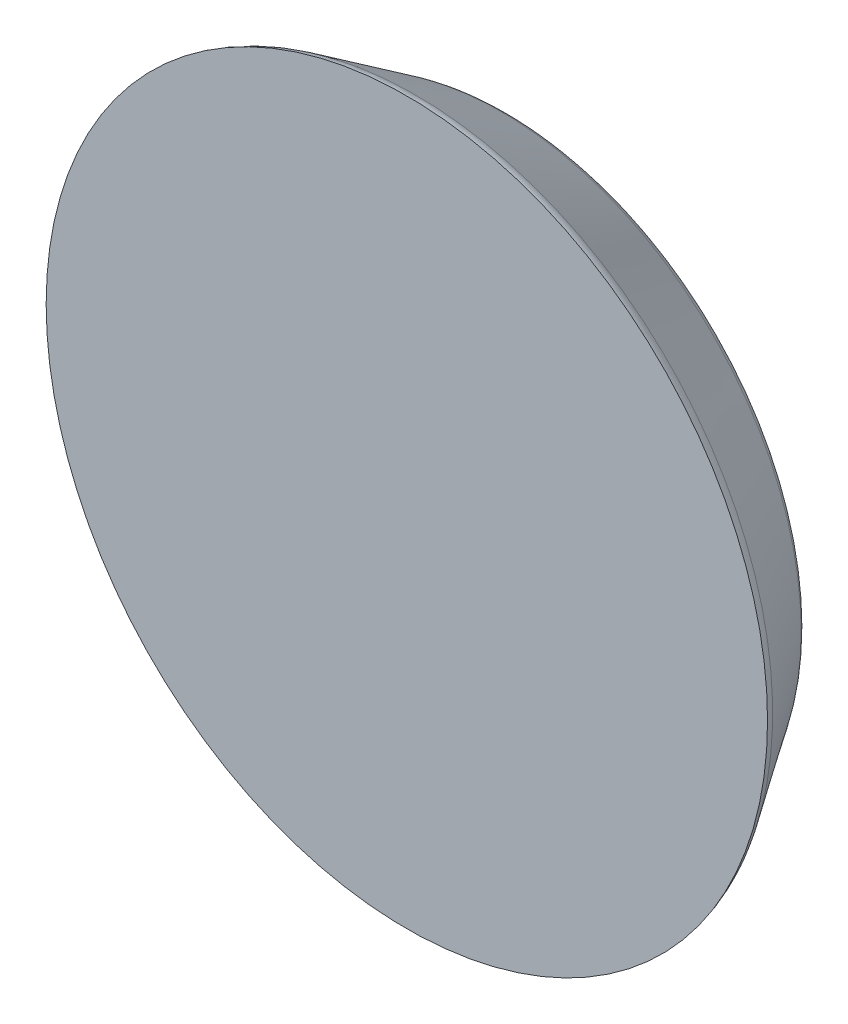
ISO-10303-21;
HEADER;
FILE_DESCRIPTION(('STEP AP214'),'2;1');
FILE_NAME('part.step','',(''),(''),'','','');
FILE_SCHEMA(('AUTOMOTIVE_DESIGN { 1 0 10303 214 1 1 1 1 }'));
ENDSEC;
DATA;
#1=APPLICATION_CONTEXT('core data for automotive mechanical design processes');
#2=APPLICATION_PROTOCOL_DEFINITION('international standard','automotive_design',2000,#1);
#3=PRODUCT_CONTEXT('',#1,'mechanical');
#4=PRODUCT('Part','Part','',(#3));
#5=PRODUCT_RELATED_PRODUCT_CATEGORY('part','',(#4));
#6=PRODUCT_DEFINITION_FORMATION('','',#4);
#7=PRODUCT_DEFINITION_CONTEXT('part definition',#1,'design');
#8=PRODUCT_DEFINITION('design','',#6,#7);
#9=PRODUCT_DEFINITION_SHAPE('','',#8);
#10=(LENGTH_UNIT() NAMED_UNIT(*) SI_UNIT(.MILLI.,.METRE.));
#11=(NAMED_UNIT(*) PLANE_ANGLE_UNIT() SI_UNIT($,.RADIAN.));
#12=(NAMED_UNIT(*) SI_UNIT($,.STERADIAN.) SOLID_ANGLE_UNIT());
#13=UNCERTAINTY_MEASURE_WITH_UNIT(LENGTH_MEASURE(1.E-05),#10,'distance_accuracy_value','');
#14=(GEOMETRIC_REPRESENTATION_CONTEXT(3) GLOBAL_UNCERTAINTY_ASSIGNED_CONTEXT((#13)) GLOBAL_UNIT_ASSIGNED_CONTEXT((#10,
#11,#12)) REPRESENTATION_CONTEXT('',''));
#15=CARTESIAN_POINT('',(0.,0.,0.));
#16=DIRECTION('',(0.,0.,1.));
#17=DIRECTION('',(1.,0.,0.));
#18=AXIS2_PLACEMENT_3D('',#15,#16,#17);
#19=CARTESIAN_POINT('',(304.348612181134,145.,0.));
#20=DIRECTION('',(0.,0.,-1.));
#21=DIRECTION('',(-1.,0.,0.));
#22=AXIS2_PLACEMENT_3D('',#19,#20,#21);
#23=PLANE('',#22);
#24=CARTESIAN_POINT('',(296.5,145.,0.));
#25=DIRECTION('',(0.,0.,1.));
#26=DIRECTION('',(1.,0.,0.));
#27=AXIS2_PLACEMENT_3D('',#24,#25,#26);
#28=CIRCLE('',#27,15.697224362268);
#29=CARTESIAN_POINT('',(312.197224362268,145.,0.));
#30=VERTEX_POINT('',#29);
#31=EDGE_CURVE('E30',#30,#30,#28,.T.);
#32=ORIENTED_EDGE('',*,*,#31,.F.);
#33=EDGE_LOOP('',(#32));
#34=FACE_BOUND('',#33,.T.);
#35=ADVANCED_FACE('F16',(#34),#23,.T.);
#36=CARTESIAN_POINT('',(296.5,145.,1.5));
#37=DIRECTION('',(0.,0.,-1.));
#38=DIRECTION('',(-1.,0.,0.));
#39=AXIS2_PLACEMENT_3D('',#36,#37,#38);
#40=TOROIDAL_SURFACE('',#39,15.697224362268,1.5);
#41=ORIENTED_EDGE('',*,*,#31,.T.);
#42=EDGE_LOOP('',(#41));
#43=FACE_BOUND('',#42,.T.);
#44=CARTESIAN_POINT('',(296.5,145.,0.667949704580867));
#45=DIRECTION('',(0.,0.,1.));
#46=DIRECTION('',(1.,0.,0.));
#47=AXIS2_PLACEMENT_3D('',#44,#45,#46);
#48=CIRCLE('',#47,16.9452998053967);
#49=CARTESIAN_POINT('',(279.554700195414,145.,0.667949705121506));
#50=VERTEX_POINT('',#49);
#51=EDGE_CURVE('E58',#50,#50,#48,.T.);
#52=ORIENTED_EDGE('',*,*,#51,.F.);
#53=EDGE_LOOP('',(#52));
#54=FACE_BOUND('',#53,.T.);
#55=ADVANCED_FACE('F67',(#43,#54),#40,.T.);
#56=CARTESIAN_POINT('',(296.5,145.,5.49580922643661));
#57=DIRECTION('',(0.,0.,1.));
#58=DIRECTION('',(1.,0.,0.));
#59=AXIS2_PLACEMENT_3D('',#56,#57,#58);
#60=CONICAL_SURFACE('',#59,20.1638728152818,0.588002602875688);
#61=ORIENTED_EDGE('',*,*,#51,.T.);
#62=EDGE_LOOP('',(#61));
#63=FACE_BOUND('',#62,.T.);
#64=CARTESIAN_POINT('',(296.5,145.,5.49580922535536));
#65=DIRECTION('',(0.,0.,-1.));
#66=DIRECTION('',(-1.,0.,0.));
#67=AXIS2_PLACEMENT_3D('',#64,#65,#66);
#68=CIRCLE('',#67,20.1638728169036);
#69=CARTESIAN_POINT('',(276.336127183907,145.,5.49580922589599));
#70=VERTEX_POINT('',#69);
#71=EDGE_CURVE('E25',#70,#70,#68,.F.);
#72=ORIENTED_EDGE('',*,*,#71,.F.);
#73=EDGE_LOOP('',(#72));
#74=FACE_BOUND('',#73,.T.);
#75=ADVANCED_FACE('F50',(#63,#74),#60,.T.);
#76=CARTESIAN_POINT('',(296.5,145.,6.32785951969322));
#77=DIRECTION('',(0.,0.,-1.));
#78=DIRECTION('',(-1.,0.,0.));
#79=AXIS2_PLACEMENT_3D('',#76,#77,#78);
#80=TOROIDAL_SURFACE('',#79,18.9157973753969,1.5);
#81=ORIENTED_EDGE('',*,*,#71,.T.);
#82=EDGE_LOOP('',(#81));
#83=FACE_BOUND('',#82,.T.);
#84=CARTESIAN_POINT('',(296.5,145.,6.));
#85=DIRECTION('',(0.,0.,-1.));
#86=DIRECTION('',(-1.,0.,0.));
#87=AXIS2_PLACEMENT_3D('',#84,#85,#86);
#88=CIRCLE('',#87,20.3795282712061);
#89=CARTESIAN_POINT('',(316.879528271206,145.,6.));
#90=VERTEX_POINT('',#89);
#91=EDGE_CURVE('E11',#90,#90,#88,.F.);
#92=ORIENTED_EDGE('',*,*,#91,.F.);
#93=EDGE_LOOP('',(#92));
#94=FACE_BOUND('',#93,.T.);
#95=ADVANCED_FACE('F41',(#83,#94),#80,.T.);
#96=CARTESIAN_POINT('',(306.689764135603,145.,6.));
#97=DIRECTION('',(0.,0.,1.));
#98=DIRECTION('',(1.,0.,0.));
#99=AXIS2_PLACEMENT_3D('',#96,#97,#98);
#100=PLANE('',#99);
#101=ORIENTED_EDGE('',*,*,#91,.T.);
#102=EDGE_LOOP('',(#101));
#103=FACE_BOUND('',#102,.T.);
#104=ADVANCED_FACE('F43',(#103),#100,.T.);
#105=CLOSED_SHELL('',(#35,#55,#75,#95,#104));
#106=MANIFOLD_SOLID_BREP('B1',#105);
#107=ADVANCED_BREP_SHAPE_REPRESENTATION('',(#18,#106),#14);
#108=SHAPE_DEFINITION_REPRESENTATION(#9,#107);
ENDSEC;
END-ISO-10303-21;
